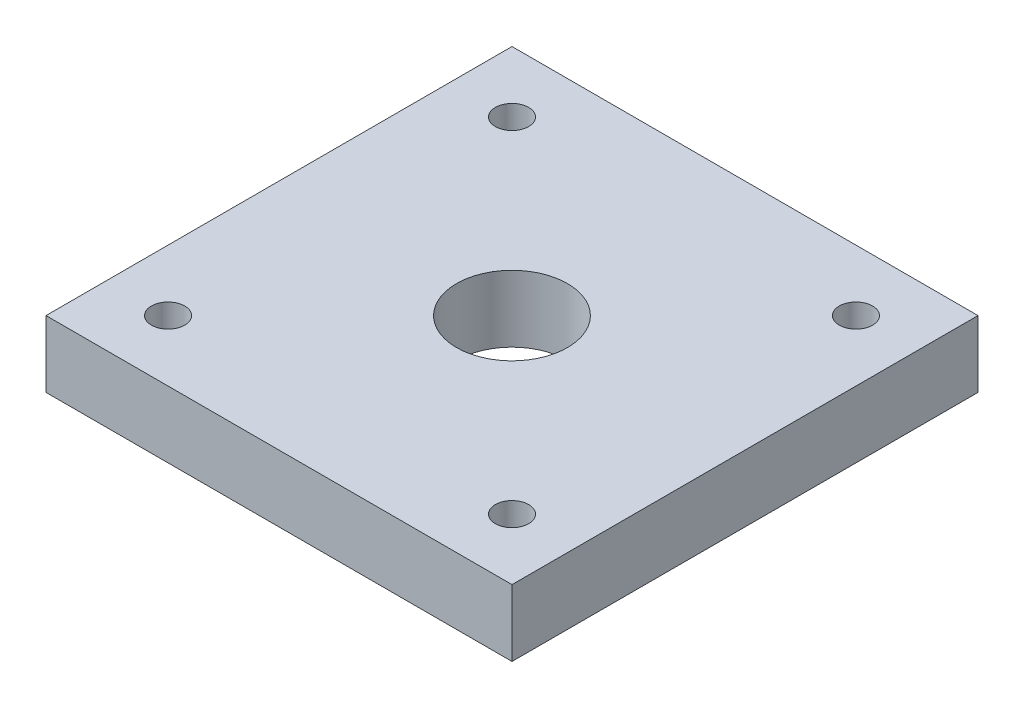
from build123d import *

# Parameters (mm, degrees)
SKETCH1_W           = 42
SKETCH1_H           = 42
SKETCH1_R           = 1.5
SKETCH1_R_2         = 5
BOSS_EXTRUDE1_DEPTH = 6


with BuildPart() as part:
    # Sketch1 → Boss-Extrude1 (new body)
    with BuildSketch(Plane(origin=(0, 0, 0), x_dir=(1, 0, 0), z_dir=(0, 1, 0))):
        with Locations((21, 21)):
            Rectangle(SKETCH1_W, SKETCH1_H)
        with Locations(Location((5.5, 36.5, 0), (0, 0, 270))):
            Circle(SKETCH1_R, mode=Mode.SUBTRACT)
        with Locations(Location((36.5, 36.5, 0), (0, 0, 270))):
            Circle(SKETCH1_R, mode=Mode.SUBTRACT)
        with Locations(Location((36.5, 5.5, 0), (0, 0, 270))):
            Circle(SKETCH1_R, mode=Mode.SUBTRACT)
        with Locations(Location((5.5, 5.5, 0), (0, 0, 270))):
            Circle(SKETCH1_R, mode=Mode.SUBTRACT)
        with Locations(Location((21, 21, 0), (0, 0, 270))):
            Circle(SKETCH1_R_2, mode=Mode.SUBTRACT)
    extrude(amount=BOSS_EXTRUDE1_DEPTH)


solid = part.part
